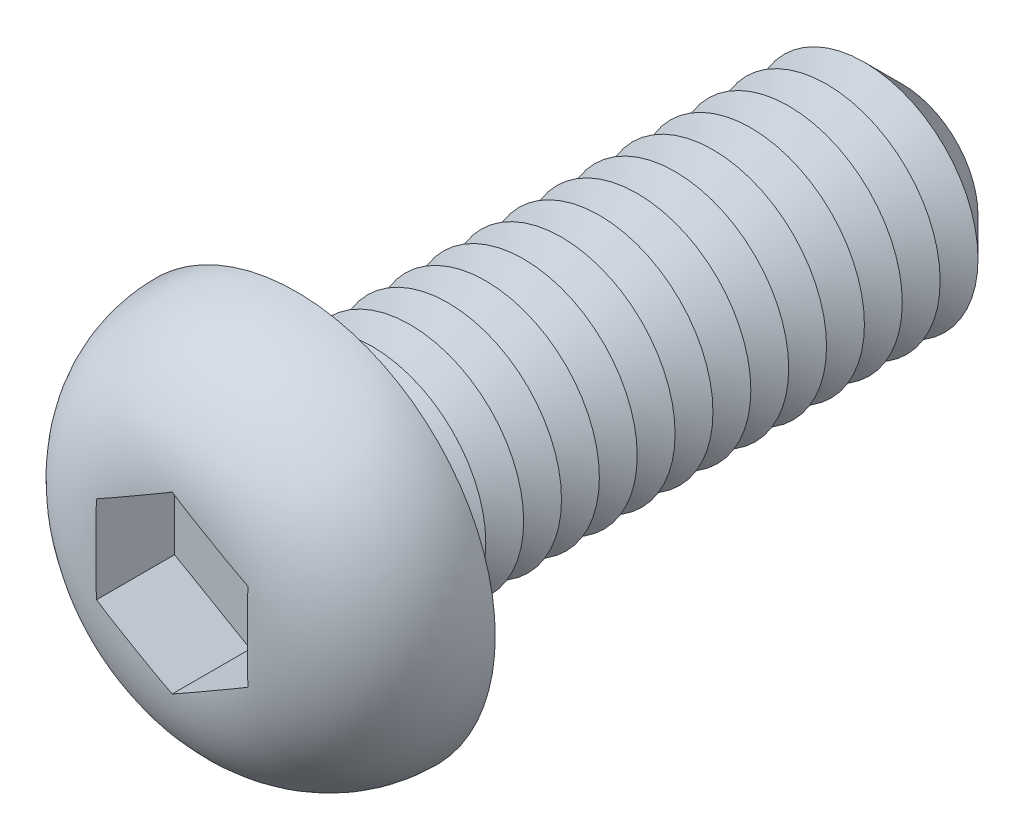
from build123d import *

# Parameters (mm, degrees)
CUT_EXTRUDE1_DEPTH  = 2.08
SKETCH4_R           = 3
BOSS_EXTRUDE1_DEPTH = 16
CHAMFER1_SIZE       = 1
LPATTERN1_COUNT     = 14
LPATTERN1_PITCH     = 1
FILLET2_R           = 0.5
SKETCH6_R           = 0.8
CUT_EXTRUDE2_DEPTH  = 17.22


with BuildPart() as part:
    # Sketch2 → Revolve1 (revolve)
    with BuildSketch(Plane(origin=(0, 0, 0), x_dir=(0, 0, -1), z_dir=(1, 0, 0)), mode=Mode.PRIVATE) as revolve1_sk:
        with BuildLine():
            Line((0, 0), (-3.3, 0))
            Line((-3.3, 0), (-3.3, 1.95))
            ThreePointArc((-3.3, 1.95), (-2.333452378, 4.283452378), (0, 5.25))
            Line((0, 5.25), (0, 0))
        make_face()
    revolve(revolve1_sk.sketch.rotate(Axis((0, 0, 47.934239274), (0, 0, -1)), 90), axis=Axis((0, 0, 47.934239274), (0, 0, -1)))

    # Sketch3 → Cut-Extrude1 (cut)
    with BuildSketch(Plane.XY.offset(3.3)):
        Polygon((0, 2.309401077), (-2, 1.154700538), (-2, -1.154700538), (0, -2.309401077), (2, -1.154700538), (2, 1.154700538), align=None)
    extrude(amount=-CUT_EXTRUDE1_DEPTH, mode=Mode.SUBTRACT)

    # Sketch4 → Boss-Extrude1 (add)
    with BuildSketch(Plane(origin=(0, 0, 0), x_dir=(-1, 0, 0), z_dir=(0, 0, -1))):
        with Locations(Location((0, 0, 0), (0, 0, 180))):
            Circle(SKETCH4_R)
    extrude(amount=BOSS_EXTRUDE1_DEPTH)

    # Chamfer1
    chamfer1_edges = [part.edges().sort_by_distance(p)[0] for p in [
        (-3, 0, -16),
    ]]
    chamfer(chamfer1_edges, length=CHAMFER1_SIZE)

    # Sketch5 → Cut-Revolve1 (revolve, cut)
    with BuildSketch(Plane(origin=(0, 0, 0), x_dir=(0, 0, -1), z_dir=(1, 0, 0)), mode=Mode.PRIVATE) as cut_revolve1_sk:
        Polygon((1, 3), (2, 3), (1.5, 2.133974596), align=None)
    cut_revolve1 = revolve(cut_revolve1_sk.sketch.rotate(Axis((0, 0, 47.934239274), (0, 0, -1)), 90), axis=Axis((0, 0, 47.934239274), (0, 0, -1)), mode=Mode.SUBTRACT)

    # LPattern1: Cut-Revolve1 ×14
    with Locations(*[(0, 0, -i * LPATTERN1_PITCH) for i in range(1, LPATTERN1_COUNT)]):
        add(cut_revolve1, mode=Mode.SUBTRACT)

    # Fillet2
    fillet2_edges = [part.edges().sort_by_distance(p)[0] for p in [
        (-3, 0, 0),
    ]]
    fillet(fillet2_edges, radius=FILLET2_R)

    # Sketch6 → Cut-Extrude2 (cut)
    with BuildSketch(Plane.XY.offset(1.22)):
        Circle(SKETCH6_R)
    extrude(amount=-CUT_EXTRUDE2_DEPTH, mode=Mode.SUBTRACT)


solid = part.part
